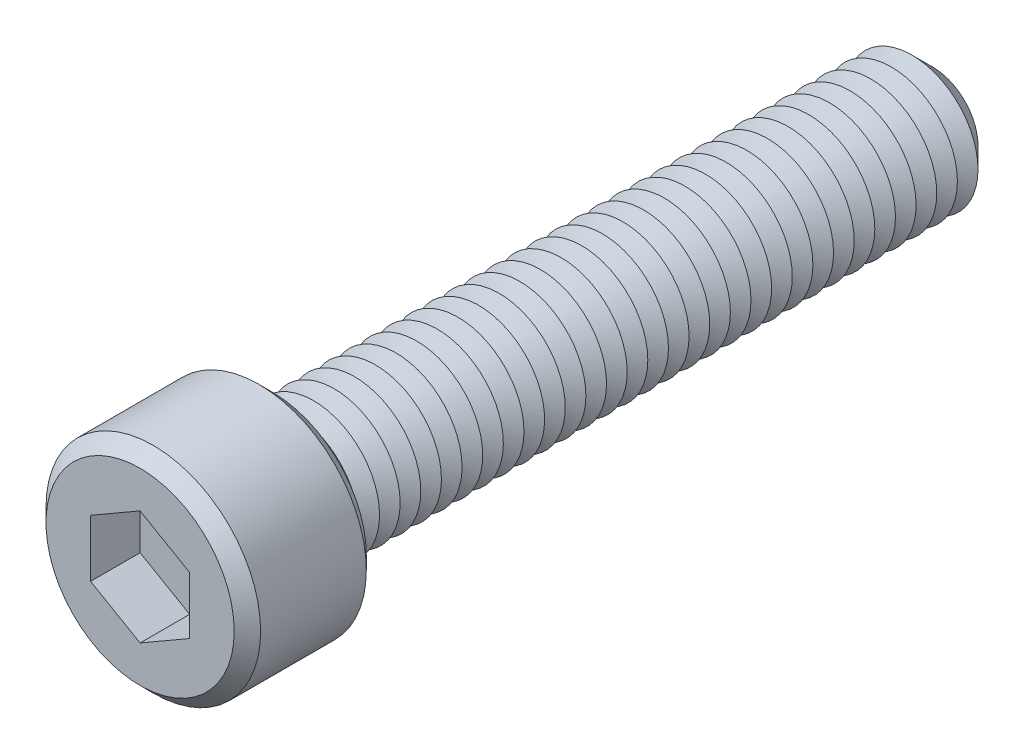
from build123d import *

# Parameters (mm, degrees)
SKETCH1_R           = 6.5
BOSS_EXTRUDE1_DEPTH = 8
SKETCH2_R           = 4
BOSS_EXTRUDE2_DEPTH = 40
CHAMFER1_SIZE       = 1.25
LPATTERN1_COUNT     = 31
LPATTERN1_PITCH     = 1.25
CUT_EXTRUDE1_DEPTH  = 3
SKETCH6_R           = 0.9
CUT_EXTRUDE2_DEPTH  = 45
CHAMFER2_SIZE       = 0.8


with BuildPart() as part:
    # Sketch1 → Boss-Extrude1 (new body)
    with BuildSketch(Plane.XY):
        Circle(SKETCH1_R)
    extrude(amount=BOSS_EXTRUDE1_DEPTH)

    # Sketch2 → Boss-Extrude2 (add)
    with BuildSketch(Plane(origin=(0, 0, 0), x_dir=(-1, 0, 0), z_dir=(0, 0, -1))):
        Circle(SKETCH2_R)
    extrude(amount=BOSS_EXTRUDE2_DEPTH)

    # Chamfer1
    chamfer1_edges = [part.edges().sort_by_distance(p)[0] for p in [
        (4, 0, -40),
    ]]
    chamfer(chamfer1_edges, length=CHAMFER1_SIZE)

    # Sketch4 → Cut-Revolve1 (revolve, cut)
    with BuildSketch(Plane(origin=(0, 0, 0), x_dir=(0, 0, -1), z_dir=(1, 0, 0)), mode=Mode.PRIVATE) as cut_revolve1_sk:
        Polygon((0, 4), (0.625, 2.917468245), (1.25, 4), align=None)
    cut_revolve1 = revolve(cut_revolve1_sk.sketch.rotate(Axis((0, 0, 2.512122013), (0, 0, -1)), 90), axis=Axis((0, 0, 2.512122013), (0, 0, -1)), mode=Mode.SUBTRACT)

    # LPattern1: Cut-Revolve1 ×31
    with Locations(*[(0, 0, -i * LPATTERN1_PITCH) for i in range(1, LPATTERN1_COUNT)]):
        add(cut_revolve1, mode=Mode.SUBTRACT)

    # Sketch5 → Cut-Extrude1 (cut)
    with BuildSketch(Plane.XY.offset(8)):
        Polygon((0, 3.464101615), (-3, 1.732050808), (-3, -1.732050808), (0, -3.464101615), (3, -1.732050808), (3, 1.732050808), align=None)
    extrude(amount=-CUT_EXTRUDE1_DEPTH, mode=Mode.SUBTRACT)

    # Sketch6 → Cut-Extrude2 (cut)
    with BuildSketch(Plane.XY.offset(5)):
        Circle(SKETCH6_R)
    extrude(amount=-CUT_EXTRUDE2_DEPTH, mode=Mode.SUBTRACT)

    # Chamfer2
    chamfer2_edges = [part.edges().sort_by_distance(p)[0] for p in [
        (-6.5, 0, 0),
        (-6.5, 0, 8),
    ]]
    chamfer(chamfer2_edges, length=CHAMFER2_SIZE)


solid = part.part
